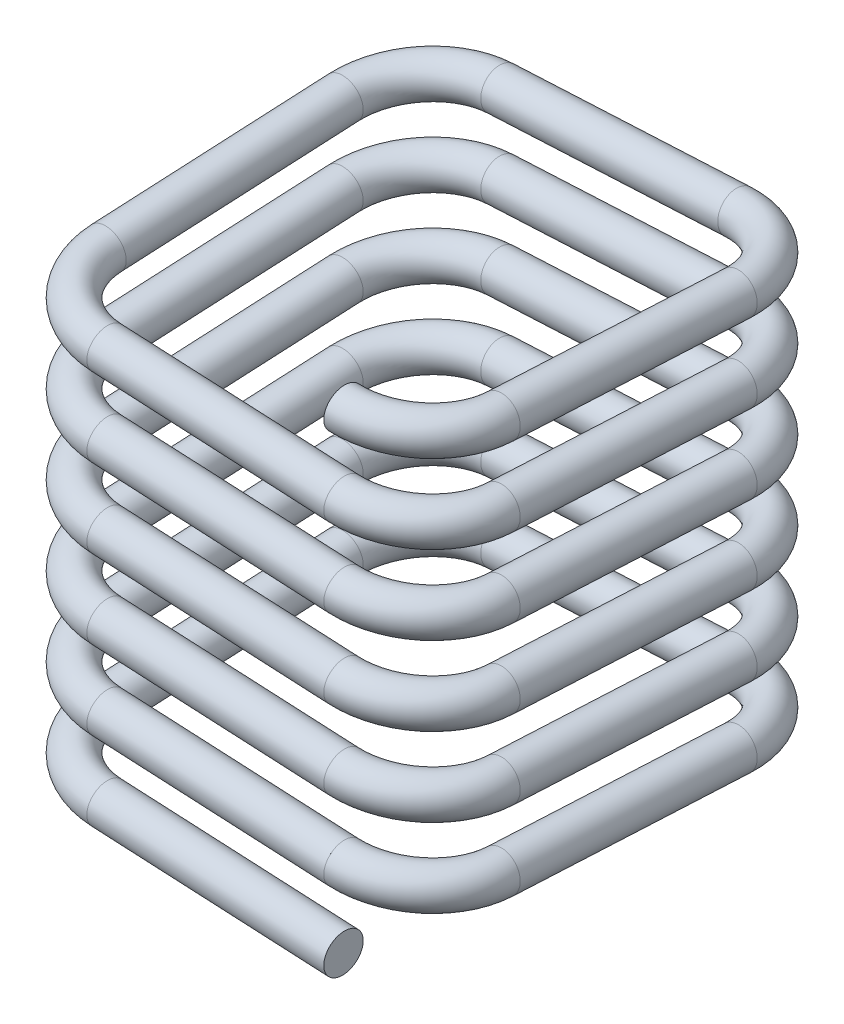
ISO-10303-21;
HEADER;
FILE_DESCRIPTION(('STEP AP214'),'2;1');
FILE_NAME('part.step','',(''),(''),'','','');
FILE_SCHEMA(('AUTOMOTIVE_DESIGN { 1 0 10303 214 1 1 1 1 }'));
ENDSEC;
DATA;
#1=APPLICATION_CONTEXT('core data for automotive mechanical design processes');
#2=APPLICATION_PROTOCOL_DEFINITION('international standard','automotive_design',2000,#1);
#3=PRODUCT_CONTEXT('',#1,'mechanical');
#4=PRODUCT('Part','Part','',(#3));
#5=PRODUCT_RELATED_PRODUCT_CATEGORY('part','',(#4));
#6=PRODUCT_DEFINITION_FORMATION('','',#4);
#7=PRODUCT_DEFINITION_CONTEXT('part definition',#1,'design');
#8=PRODUCT_DEFINITION('design','',#6,#7);
#9=PRODUCT_DEFINITION_SHAPE('','',#8);
#10=(LENGTH_UNIT() NAMED_UNIT(*) SI_UNIT(.MILLI.,.METRE.));
#11=(NAMED_UNIT(*) PLANE_ANGLE_UNIT() SI_UNIT($,.RADIAN.));
#12=(NAMED_UNIT(*) SI_UNIT($,.STERADIAN.) SOLID_ANGLE_UNIT());
#13=UNCERTAINTY_MEASURE_WITH_UNIT(LENGTH_MEASURE(1.E-05),#10,'distance_accuracy_value','');
#14=(GEOMETRIC_REPRESENTATION_CONTEXT(3) GLOBAL_UNCERTAINTY_ASSIGNED_CONTEXT((#13)) GLOBAL_UNIT_ASSIGNED_CONTEXT((#10,
#11,#12)) REPRESENTATION_CONTEXT('',''));
#15=CARTESIAN_POINT('',(0.,0.,0.));
#16=DIRECTION('',(0.,0.,1.));
#17=DIRECTION('',(1.,0.,0.));
#18=AXIS2_PLACEMENT_3D('',#15,#16,#17);
#19=CARTESIAN_POINT('',(30.0248911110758,120.,30.0248911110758));
#20=DIRECTION('',(-0.0498754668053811,-0.997509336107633,0.0498754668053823));
#21=DIRECTION('',(0.,-0.0499376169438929,-0.998752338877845));
#22=AXIS2_PLACEMENT_3D('',#19,#20,#21);
#23=TOROIDAL_SURFACE('',#22,20.,5.);
#24=CARTESIAN_POINT('',(50.,119.00373521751,30.0747043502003));
#25=DIRECTION('',(0.,0.0499376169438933,0.998752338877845));
#26=DIRECTION('',(0.294924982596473,-0.954328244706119,0.0477164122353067));
#27=AXIS2_PLACEMENT_3D('',#24,#25,#26);
#28=CIRCLE('',#27,5.);
#29=CARTESIAN_POINT('',(54.9937772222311,118.754669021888,30.0871576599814));
#30=VERTEX_POINT('',#29);
#31=EDGE_CURVE('E48',#30,#30,#28,.T.);
#32=CARTESIAN_POINT('',(30.0747043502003,120.99626478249,50.));
#33=DIRECTION('',(-0.998752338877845,0.0499376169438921,0.));
#34=DIRECTION('',(-0.0460117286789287,-0.920234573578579,0.388653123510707));
#35=AXIS2_PLACEMENT_3D('',#32,#33,#34);
#36=CIRCLE('',#35,5.);
#37=CARTESIAN_POINT('',(30.0871576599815,121.245330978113,54.9937772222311));
#38=VERTEX_POINT('',#37);
#39=EDGE_CURVE('E11',#38,#38,#36,.T.);
#40=CARTESIAN_POINT('',(30.0248911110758,120.,30.0248911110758));
#41=DIRECTION('',(-0.0498754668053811,-0.997509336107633,0.0498754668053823));
#42=DIRECTION('',(0.,-0.0499376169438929,-0.998752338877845));
#43=AXIS2_PLACEMENT_3D('',#40,#41,#42);
#44=CIRCLE('',#43,25.);
#45=EDGE_CURVE('',#30,#38,#44,.T.);
#46=ORIENTED_EDGE('',*,*,#31,.T.);
#47=ORIENTED_EDGE('',*,*,#39,.F.);
#48=ORIENTED_EDGE('',*,*,#45,.T.);
#49=ORIENTED_EDGE('',*,*,#45,.F.);
#50=EDGE_LOOP('',(#46,#48,#47,#49));
#51=FACE_BOUND('',#50,.T.);
#52=ADVANCED_FACE('F42',(#51),#23,.T.);
#53=CARTESIAN_POINT('',(50.,115.99626478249,-30.0747043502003));
#54=DIRECTION('',(0.,0.0499376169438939,0.998752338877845));
#55=DIRECTION('',(0.,-0.998752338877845,0.0499376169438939));
#56=AXIS2_PLACEMENT_3D('',#53,#54,#55);
#57=CYLINDRICAL_SURFACE('',#56,5.);
#58=CARTESIAN_POINT('',(50.,115.99626478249,-30.0747043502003));
#59=DIRECTION('',(0.,0.0499376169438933,0.998752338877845));
#60=DIRECTION('',(0.294924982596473,-0.954328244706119,0.0477164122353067));
#61=AXIS2_PLACEMENT_3D('',#58,#59,#60);
#62=CIRCLE('',#61,5.);
#63=CARTESIAN_POINT('',(54.9937772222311,116.245330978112,-30.0871576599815));
#64=VERTEX_POINT('',#63);
#65=EDGE_CURVE('E52',#64,#64,#62,.T.);
#66=ORIENTED_EDGE('',*,*,#65,.T.);
#67=EDGE_LOOP('',(#66));
#68=FACE_BOUND('',#67,.T.);
#69=ORIENTED_EDGE('',*,*,#31,.F.);
#70=EDGE_LOOP('',(#69));
#71=FACE_BOUND('',#70,.T.);
#72=ADVANCED_FACE('F95',(#68,#71),#57,.T.);
#73=CARTESIAN_POINT('',(30.0248911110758,115.,-30.0248911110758));
#74=DIRECTION('',(0.0498754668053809,-0.997509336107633,0.0498754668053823));
#75=DIRECTION('',(0.,-0.0499376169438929,-0.998752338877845));
#76=AXIS2_PLACEMENT_3D('',#73,#74,#75);
#77=TOROIDAL_SURFACE('',#76,20.,5.);
#78=CARTESIAN_POINT('',(30.0747043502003,114.00373521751,-50.));
#79=DIRECTION('',(0.998752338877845,0.0499376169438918,0.));
#80=DIRECTION('',(0.0489463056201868,-0.978926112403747,-0.198262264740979));
#81=AXIS2_PLACEMENT_3D('',#78,#79,#80);
#82=CIRCLE('',#81,5.);
#83=CARTESIAN_POINT('',(30.0871576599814,113.754669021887,-54.9937772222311));
#84=VERTEX_POINT('',#83);
#85=EDGE_CURVE('E56',#84,#84,#82,.T.);
#86=CARTESIAN_POINT('',(30.0248911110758,115.,-30.0248911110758));
#87=DIRECTION('',(0.0498754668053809,-0.997509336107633,0.0498754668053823));
#88=DIRECTION('',(0.,-0.0499376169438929,-0.998752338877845));
#89=AXIS2_PLACEMENT_3D('',#86,#87,#88);
#90=CIRCLE('',#89,25.);
#91=EDGE_CURVE('',#84,#64,#90,.T.);
#92=ORIENTED_EDGE('',*,*,#85,.T.);
#93=ORIENTED_EDGE('',*,*,#65,.F.);
#94=ORIENTED_EDGE('',*,*,#91,.T.);
#95=ORIENTED_EDGE('',*,*,#91,.F.);
#96=EDGE_LOOP('',(#92,#94,#93,#95));
#97=FACE_BOUND('',#96,.T.);
#98=ADVANCED_FACE('F99',(#97),#77,.T.);
#99=CARTESIAN_POINT('',(-30.0747043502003,110.99626478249,-50.));
#100=DIRECTION('',(0.998752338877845,0.0499376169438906,0.));
#101=DIRECTION('',(-0.0499376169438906,0.998752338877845,0.));
#102=AXIS2_PLACEMENT_3D('',#99,#100,#101);
#103=CYLINDRICAL_SURFACE('',#102,5.);
#104=CARTESIAN_POINT('',(-30.0747043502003,110.99626478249,-50.));
#105=DIRECTION('',(0.998752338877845,0.0499376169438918,0.));
#106=DIRECTION('',(0.0489463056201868,-0.978926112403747,-0.198262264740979));
#107=AXIS2_PLACEMENT_3D('',#104,#105,#106);
#108=CIRCLE('',#107,5.);
#109=CARTESIAN_POINT('',(-30.0871576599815,111.245330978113,-54.993777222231));
#110=VERTEX_POINT('',#109);
#111=EDGE_CURVE('E61',#110,#110,#108,.T.);
#112=ORIENTED_EDGE('',*,*,#111,.T.);
#113=EDGE_LOOP('',(#112));
#114=FACE_BOUND('',#113,.T.);
#115=ORIENTED_EDGE('',*,*,#85,.F.);
#116=EDGE_LOOP('',(#115));
#117=FACE_BOUND('',#116,.T.);
#118=ADVANCED_FACE('F105',(#114,#117),#103,.T.);
#119=CARTESIAN_POINT('',(-30.0248911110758,110.,-30.0248911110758));
#120=DIRECTION('',(0.0498754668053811,-0.997509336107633,-0.0498754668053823));
#121=DIRECTION('',(0.,0.0499376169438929,-0.998752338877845));
#122=AXIS2_PLACEMENT_3D('',#119,#120,#121);
#123=TOROIDAL_SURFACE('',#122,20.,5.);
#124=CARTESIAN_POINT('',(-50.,109.00373521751,-30.0747043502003));
#125=DIRECTION('',(0.,0.049937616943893,-0.998752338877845));
#126=DIRECTION('',(-0.099626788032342,-0.993783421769,-0.0496891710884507));
#127=AXIS2_PLACEMENT_3D('',#124,#125,#126);
#128=CIRCLE('',#127,5.);
#129=CARTESIAN_POINT('',(-54.9937772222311,108.754669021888,-30.0871576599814));
#130=VERTEX_POINT('',#129);
#131=EDGE_CURVE('E64',#130,#130,#128,.T.);
#132=CARTESIAN_POINT('',(-30.0248911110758,110.,-30.0248911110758));
#133=DIRECTION('',(0.0498754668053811,-0.997509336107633,-0.0498754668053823));
#134=DIRECTION('',(0.,0.0499376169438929,-0.998752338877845));
#135=AXIS2_PLACEMENT_3D('',#132,#133,#134);
#136=CIRCLE('',#135,25.);
#137=EDGE_CURVE('',#130,#110,#136,.T.);
#138=ORIENTED_EDGE('',*,*,#131,.T.);
#139=ORIENTED_EDGE('',*,*,#111,.F.);
#140=ORIENTED_EDGE('',*,*,#137,.T.);
#141=ORIENTED_EDGE('',*,*,#137,.F.);
#142=EDGE_LOOP('',(#138,#140,#139,#141));
#143=FACE_BOUND('',#142,.T.);
#144=ADVANCED_FACE('F112',(#143),#123,.T.);
#145=CARTESIAN_POINT('',(-50.,105.99626478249,30.0747043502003));
#146=DIRECTION('',(0.,0.049937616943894,-0.998752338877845));
#147=DIRECTION('',(0.,0.998752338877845,0.0499376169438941));
#148=AXIS2_PLACEMENT_3D('',#145,#146,#147);
#149=CYLINDRICAL_SURFACE('',#148,5.);
#150=CARTESIAN_POINT('',(-50.,105.99626478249,30.0747043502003));
#151=DIRECTION('',(0.,0.049937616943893,-0.998752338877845));
#152=DIRECTION('',(-0.099626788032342,-0.993783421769,-0.0496891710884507));
#153=AXIS2_PLACEMENT_3D('',#150,#151,#152);
#154=CIRCLE('',#153,5.);
#155=CARTESIAN_POINT('',(-54.993777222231,106.245330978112,30.0871576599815));
#156=VERTEX_POINT('',#155);
#157=EDGE_CURVE('E67',#156,#156,#154,.T.);
#158=ORIENTED_EDGE('',*,*,#157,.T.);
#159=EDGE_LOOP('',(#158));
#160=FACE_BOUND('',#159,.T.);
#161=ORIENTED_EDGE('',*,*,#131,.F.);
#162=EDGE_LOOP('',(#161));
#163=FACE_BOUND('',#162,.T.);
#164=ADVANCED_FACE('F116',(#160,#163),#149,.T.);
#165=CARTESIAN_POINT('',(-30.0248911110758,105.,30.0248911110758));
#166=DIRECTION('',(-0.0498754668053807,-0.997509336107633,-0.0498754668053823));
#167=DIRECTION('',(0.,0.0499376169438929,-0.998752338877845));
#168=AXIS2_PLACEMENT_3D('',#165,#166,#167);
#169=TOROIDAL_SURFACE('',#168,20.,5.);
#170=CARTESIAN_POINT('',(-30.0747043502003,104.00373521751,50.));
#171=DIRECTION('',(-0.998752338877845,0.0499376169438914,0.));
#172=DIRECTION('',(-0.0499376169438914,-0.998752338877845,0.));
#173=AXIS2_PLACEMENT_3D('',#170,#171,#172);
#174=CIRCLE('',#173,5.);
#175=CARTESIAN_POINT('',(-30.0871576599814,103.754669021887,54.9937772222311));
#176=VERTEX_POINT('',#175);
#177=EDGE_CURVE('E70',#176,#176,#174,.T.);
#178=CARTESIAN_POINT('',(-30.0248911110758,105.,30.0248911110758));
#179=DIRECTION('',(-0.0498754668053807,-0.997509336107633,-0.0498754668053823));
#180=DIRECTION('',(0.,0.0499376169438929,-0.998752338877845));
#181=AXIS2_PLACEMENT_3D('',#178,#179,#180);
#182=CIRCLE('',#181,25.);
#183=EDGE_CURVE('',#176,#156,#182,.T.);
#184=ORIENTED_EDGE('',*,*,#177,.T.);
#185=ORIENTED_EDGE('',*,*,#157,.F.);
#186=ORIENTED_EDGE('',*,*,#183,.T.);
#187=ORIENTED_EDGE('',*,*,#183,.F.);
#188=EDGE_LOOP('',(#184,#186,#185,#187));
#189=FACE_BOUND('',#188,.T.);
#190=ADVANCED_FACE('F77',(#189),#169,.T.);
#191=CARTESIAN_POINT('',(-30.0747043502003,104.00373521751,50.));
#192=DIRECTION('',(0.998752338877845,-0.0499376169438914,0.));
#193=DIRECTION('',(0.0499376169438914,0.998752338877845,0.));
#194=AXIS2_PLACEMENT_3D('',#191,#192,#193);
#195=CYLINDRICAL_SURFACE('',#194,5.);
#196=ORIENTED_EDGE('',*,*,#177,.F.);
#197=EDGE_LOOP('',(#196));
#198=FACE_BOUND('',#197,.T.);
#199=CARTESIAN_POINT('',(30.0747043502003,100.99626478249,50.));
#200=DIRECTION('',(-0.998752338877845,0.0499376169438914,0.));
#201=DIRECTION('',(-0.0499376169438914,-0.998752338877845,0.));
#202=AXIS2_PLACEMENT_3D('',#199,#200,#201);
#203=CIRCLE('',#202,5.);
#204=CARTESIAN_POINT('',(29.8250162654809,96.0025030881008,50.));
#205=VERTEX_POINT('',#204);
#206=EDGE_CURVE('E71',#205,#205,#203,.T.);
#207=ORIENTED_EDGE('',*,*,#206,.T.);
#208=EDGE_LOOP('',(#207));
#209=FACE_BOUND('',#208,.T.);
#210=ADVANCED_FACE('F80',(#198,#209),#195,.T.);
#211=CARTESIAN_POINT('',(30.0747043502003,120.99626478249,50.));
#212=DIRECTION('',(-0.998752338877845,0.0499376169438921,0.));
#213=DIRECTION('',(-0.0460117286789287,-0.920234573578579,0.388653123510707));
#214=AXIS2_PLACEMENT_3D('',#211,#212,#213);
#215=PLANE('',#214);
#216=ORIENTED_EDGE('',*,*,#39,.T.);
#217=EDGE_LOOP('',(#216));
#218=FACE_BOUND('',#217,.T.);
#219=ADVANCED_FACE('F83',(#218),#215,.T.);
#220=CARTESIAN_POINT('',(30.0747043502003,100.99626478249,50.));
#221=DIRECTION('',(-0.998752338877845,0.0499376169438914,0.));
#222=DIRECTION('',(-0.0499376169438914,-0.998752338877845,0.));
#223=AXIS2_PLACEMENT_3D('',#220,#221,#222);
#224=PLANE('',#223);
#225=ORIENTED_EDGE('',*,*,#206,.F.);
#226=EDGE_LOOP('',(#225));
#227=FACE_BOUND('',#226,.T.);
#228=ADVANCED_FACE('F87',(#227),#224,.F.);
#229=CLOSED_SHELL('',(#52,#72,#98,#118,#144,#164,#190,#210,#219,#228));
#230=MANIFOLD_SOLID_BREP('B2',#229);
#231=CARTESIAN_POINT('',(30.0248911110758,100.,30.0248911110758));
#232=DIRECTION('',(-0.0498754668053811,-0.997509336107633,0.0498754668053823));
#233=DIRECTION('',(0.,-0.0499376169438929,-0.998752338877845));
#234=AXIS2_PLACEMENT_3D('',#231,#232,#233);
#235=TOROIDAL_SURFACE('',#234,20.,5.);
#236=CARTESIAN_POINT('',(50.,99.0037352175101,30.0747043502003));
#237=DIRECTION('',(0.,0.0499376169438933,0.998752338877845));
#238=DIRECTION('',(0.294924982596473,-0.954328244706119,0.0477164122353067));
#239=AXIS2_PLACEMENT_3D('',#236,#237,#238);
#240=CIRCLE('',#239,5.);
#241=CARTESIAN_POINT('',(54.9937772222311,98.7546690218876,30.0871576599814));
#242=VERTEX_POINT('',#241);
#243=EDGE_CURVE('E202',#242,#242,#240,.T.);
#244=CARTESIAN_POINT('',(30.0747043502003,100.99626478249,50.));
#245=DIRECTION('',(-0.998752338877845,0.0499376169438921,0.));
#246=DIRECTION('',(-0.0460117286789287,-0.920234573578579,0.388653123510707));
#247=AXIS2_PLACEMENT_3D('',#244,#245,#246);
#248=CIRCLE('',#247,5.);
#249=CARTESIAN_POINT('',(30.0871576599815,101.245330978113,54.9937772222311));
#250=VERTEX_POINT('',#249);
#251=EDGE_CURVE('E41',#250,#250,#248,.T.);
#252=CARTESIAN_POINT('',(30.0248911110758,100.,30.0248911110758));
#253=DIRECTION('',(-0.0498754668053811,-0.997509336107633,0.0498754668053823));
#254=DIRECTION('',(0.,-0.0499376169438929,-0.998752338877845));
#255=AXIS2_PLACEMENT_3D('',#252,#253,#254);
#256=CIRCLE('',#255,25.);
#257=EDGE_CURVE('',#242,#250,#256,.T.);
#258=ORIENTED_EDGE('',*,*,#243,.T.);
#259=ORIENTED_EDGE('',*,*,#251,.F.);
#260=ORIENTED_EDGE('',*,*,#257,.T.);
#261=ORIENTED_EDGE('',*,*,#257,.F.);
#262=EDGE_LOOP('',(#258,#260,#259,#261));
#263=FACE_BOUND('',#262,.T.);
#264=ADVANCED_FACE('F196',(#263),#235,.T.);
#265=CARTESIAN_POINT('',(50.,95.9962647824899,-30.0747043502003));
#266=DIRECTION('',(0.,0.0499376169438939,0.998752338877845));
#267=DIRECTION('',(0.,-0.998752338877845,0.0499376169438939));
#268=AXIS2_PLACEMENT_3D('',#265,#266,#267);
#269=CYLINDRICAL_SURFACE('',#268,5.);
#270=CARTESIAN_POINT('',(50.,95.9962647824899,-30.0747043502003));
#271=DIRECTION('',(0.,0.0499376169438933,0.998752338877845));
#272=DIRECTION('',(0.294924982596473,-0.954328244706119,0.0477164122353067));
#273=AXIS2_PLACEMENT_3D('',#270,#271,#272);
#274=CIRCLE('',#273,5.);
#275=CARTESIAN_POINT('',(54.9937772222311,96.2453309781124,-30.0871576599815));
#276=VERTEX_POINT('',#275);
#277=EDGE_CURVE('E206',#276,#276,#274,.T.);
#278=ORIENTED_EDGE('',*,*,#277,.T.);
#279=EDGE_LOOP('',(#278));
#280=FACE_BOUND('',#279,.T.);
#281=ORIENTED_EDGE('',*,*,#243,.F.);
#282=EDGE_LOOP('',(#281));
#283=FACE_BOUND('',#282,.T.);
#284=ADVANCED_FACE('F249',(#280,#283),#269,.T.);
#285=CARTESIAN_POINT('',(30.0248911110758,95.,-30.0248911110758));
#286=DIRECTION('',(0.0498754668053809,-0.997509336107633,0.0498754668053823));
#287=DIRECTION('',(0.,-0.0499376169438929,-0.998752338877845));
#288=AXIS2_PLACEMENT_3D('',#285,#286,#287);
#289=TOROIDAL_SURFACE('',#288,20.,5.);
#290=CARTESIAN_POINT('',(30.0747043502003,94.00373521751,-50.));
#291=DIRECTION('',(0.998752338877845,0.0499376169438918,0.));
#292=DIRECTION('',(0.0489463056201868,-0.978926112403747,-0.198262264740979));
#293=AXIS2_PLACEMENT_3D('',#290,#291,#292);
#294=CIRCLE('',#293,5.);
#295=CARTESIAN_POINT('',(30.0871576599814,93.7546690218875,-54.9937772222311));
#296=VERTEX_POINT('',#295);
#297=EDGE_CURVE('E210',#296,#296,#294,.T.);
#298=CARTESIAN_POINT('',(30.0248911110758,95.,-30.0248911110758));
#299=DIRECTION('',(0.0498754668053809,-0.997509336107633,0.0498754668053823));
#300=DIRECTION('',(0.,-0.0499376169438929,-0.998752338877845));
#301=AXIS2_PLACEMENT_3D('',#298,#299,#300);
#302=CIRCLE('',#301,25.);
#303=EDGE_CURVE('',#296,#276,#302,.T.);
#304=ORIENTED_EDGE('',*,*,#297,.T.);
#305=ORIENTED_EDGE('',*,*,#277,.F.);
#306=ORIENTED_EDGE('',*,*,#303,.T.);
#307=ORIENTED_EDGE('',*,*,#303,.F.);
#308=EDGE_LOOP('',(#304,#306,#305,#307));
#309=FACE_BOUND('',#308,.T.);
#310=ADVANCED_FACE('F253',(#309),#289,.T.);
#311=CARTESIAN_POINT('',(-30.0747043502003,90.99626478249,-50.));
#312=DIRECTION('',(0.998752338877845,0.0499376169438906,0.));
#313=DIRECTION('',(-0.0499376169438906,0.998752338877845,0.));
#314=AXIS2_PLACEMENT_3D('',#311,#312,#313);
#315=CYLINDRICAL_SURFACE('',#314,5.);
#316=CARTESIAN_POINT('',(-30.0747043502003,90.99626478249,-50.));
#317=DIRECTION('',(0.998752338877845,0.0499376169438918,0.));
#318=DIRECTION('',(0.0489463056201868,-0.978926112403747,-0.198262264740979));
#319=AXIS2_PLACEMENT_3D('',#316,#317,#318);
#320=CIRCLE('',#319,5.);
#321=CARTESIAN_POINT('',(-30.0871576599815,91.2453309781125,-54.993777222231));
#322=VERTEX_POINT('',#321);
#323=EDGE_CURVE('E215',#322,#322,#320,.T.);
#324=ORIENTED_EDGE('',*,*,#323,.T.);
#325=EDGE_LOOP('',(#324));
#326=FACE_BOUND('',#325,.T.);
#327=ORIENTED_EDGE('',*,*,#297,.F.);
#328=EDGE_LOOP('',(#327));
#329=FACE_BOUND('',#328,.T.);
#330=ADVANCED_FACE('F259',(#326,#329),#315,.T.);
#331=CARTESIAN_POINT('',(-30.0248911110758,90.,-30.0248911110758));
#332=DIRECTION('',(0.0498754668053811,-0.997509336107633,-0.0498754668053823));
#333=DIRECTION('',(0.,0.0499376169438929,-0.998752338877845));
#334=AXIS2_PLACEMENT_3D('',#331,#332,#333);
#335=TOROIDAL_SURFACE('',#334,20.,5.);
#336=CARTESIAN_POINT('',(-50.,89.0037352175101,-30.0747043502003));
#337=DIRECTION('',(0.,0.049937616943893,-0.998752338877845));
#338=DIRECTION('',(-0.099626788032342,-0.993783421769,-0.0496891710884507));
#339=AXIS2_PLACEMENT_3D('',#336,#337,#338);
#340=CIRCLE('',#339,5.);
#341=CARTESIAN_POINT('',(-54.9937772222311,88.7546690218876,-30.0871576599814));
#342=VERTEX_POINT('',#341);
#343=EDGE_CURVE('E218',#342,#342,#340,.T.);
#344=CARTESIAN_POINT('',(-30.0248911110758,90.,-30.0248911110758));
#345=DIRECTION('',(0.0498754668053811,-0.997509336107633,-0.0498754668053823));
#346=DIRECTION('',(0.,0.0499376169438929,-0.998752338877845));
#347=AXIS2_PLACEMENT_3D('',#344,#345,#346);
#348=CIRCLE('',#347,25.);
#349=EDGE_CURVE('',#342,#322,#348,.T.);
#350=ORIENTED_EDGE('',*,*,#343,.T.);
#351=ORIENTED_EDGE('',*,*,#323,.F.);
#352=ORIENTED_EDGE('',*,*,#349,.T.);
#353=ORIENTED_EDGE('',*,*,#349,.F.);
#354=EDGE_LOOP('',(#350,#352,#351,#353));
#355=FACE_BOUND('',#354,.T.);
#356=ADVANCED_FACE('F266',(#355),#335,.T.);
#357=CARTESIAN_POINT('',(-50.,85.9962647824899,30.0747043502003));
#358=DIRECTION('',(0.,0.049937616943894,-0.998752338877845));
#359=DIRECTION('',(0.,0.998752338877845,0.0499376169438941));
#360=AXIS2_PLACEMENT_3D('',#357,#358,#359);
#361=CYLINDRICAL_SURFACE('',#360,5.);
#362=CARTESIAN_POINT('',(-50.,85.9962647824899,30.0747043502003));
#363=DIRECTION('',(0.,0.049937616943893,-0.998752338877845));
#364=DIRECTION('',(-0.099626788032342,-0.993783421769,-0.0496891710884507));
#365=AXIS2_PLACEMENT_3D('',#362,#363,#364);
#366=CIRCLE('',#365,5.);
#367=CARTESIAN_POINT('',(-54.993777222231,86.2453309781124,30.0871576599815));
#368=VERTEX_POINT('',#367);
#369=EDGE_CURVE('E221',#368,#368,#366,.T.);
#370=ORIENTED_EDGE('',*,*,#369,.T.);
#371=EDGE_LOOP('',(#370));
#372=FACE_BOUND('',#371,.T.);
#373=ORIENTED_EDGE('',*,*,#343,.F.);
#374=EDGE_LOOP('',(#373));
#375=FACE_BOUND('',#374,.T.);
#376=ADVANCED_FACE('F270',(#372,#375),#361,.T.);
#377=CARTESIAN_POINT('',(-30.0248911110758,85.,30.0248911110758));
#378=DIRECTION('',(-0.0498754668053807,-0.997509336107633,-0.0498754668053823));
#379=DIRECTION('',(0.,0.0499376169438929,-0.998752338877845));
#380=AXIS2_PLACEMENT_3D('',#377,#378,#379);
#381=TOROIDAL_SURFACE('',#380,20.,5.);
#382=CARTESIAN_POINT('',(-30.0747043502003,84.00373521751,50.));
#383=DIRECTION('',(-0.998752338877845,0.0499376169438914,0.));
#384=DIRECTION('',(-0.0499376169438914,-0.998752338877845,0.));
#385=AXIS2_PLACEMENT_3D('',#382,#383,#384);
#386=CIRCLE('',#385,5.);
#387=CARTESIAN_POINT('',(-30.0871576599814,83.7546690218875,54.9937772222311));
#388=VERTEX_POINT('',#387);
#389=EDGE_CURVE('E224',#388,#388,#386,.T.);
#390=CARTESIAN_POINT('',(-30.0248911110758,85.,30.0248911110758));
#391=DIRECTION('',(-0.0498754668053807,-0.997509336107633,-0.0498754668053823));
#392=DIRECTION('',(0.,0.0499376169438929,-0.998752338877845));
#393=AXIS2_PLACEMENT_3D('',#390,#391,#392);
#394=CIRCLE('',#393,25.);
#395=EDGE_CURVE('',#388,#368,#394,.T.);
#396=ORIENTED_EDGE('',*,*,#389,.T.);
#397=ORIENTED_EDGE('',*,*,#369,.F.);
#398=ORIENTED_EDGE('',*,*,#395,.T.);
#399=ORIENTED_EDGE('',*,*,#395,.F.);
#400=EDGE_LOOP('',(#396,#398,#397,#399));
#401=FACE_BOUND('',#400,.T.);
#402=ADVANCED_FACE('F231',(#401),#381,.T.);
#403=CARTESIAN_POINT('',(-30.0747043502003,84.00373521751,50.));
#404=DIRECTION('',(0.998752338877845,-0.0499376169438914,0.));
#405=DIRECTION('',(0.0499376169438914,0.998752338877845,0.));
#406=AXIS2_PLACEMENT_3D('',#403,#404,#405);
#407=CYLINDRICAL_SURFACE('',#406,5.);
#408=ORIENTED_EDGE('',*,*,#389,.F.);
#409=EDGE_LOOP('',(#408));
#410=FACE_BOUND('',#409,.T.);
#411=CARTESIAN_POINT('',(30.0747043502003,80.99626478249,50.));
#412=DIRECTION('',(-0.998752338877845,0.0499376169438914,0.));
#413=DIRECTION('',(-0.0499376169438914,-0.998752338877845,0.));
#414=AXIS2_PLACEMENT_3D('',#411,#412,#413);
#415=CIRCLE('',#414,5.);
#416=CARTESIAN_POINT('',(29.8250162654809,76.0025030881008,50.));
#417=VERTEX_POINT('',#416);
#418=EDGE_CURVE('E225',#417,#417,#415,.T.);
#419=ORIENTED_EDGE('',*,*,#418,.T.);
#420=EDGE_LOOP('',(#419));
#421=FACE_BOUND('',#420,.T.);
#422=ADVANCED_FACE('F234',(#410,#421),#407,.T.);
#423=CARTESIAN_POINT('',(30.0747043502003,100.99626478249,50.));
#424=DIRECTION('',(-0.998752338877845,0.0499376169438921,0.));
#425=DIRECTION('',(-0.0460117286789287,-0.920234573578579,0.388653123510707));
#426=AXIS2_PLACEMENT_3D('',#423,#424,#425);
#427=PLANE('',#426);
#428=ORIENTED_EDGE('',*,*,#251,.T.);
#429=EDGE_LOOP('',(#428));
#430=FACE_BOUND('',#429,.T.);
#431=ADVANCED_FACE('F237',(#430),#427,.T.);
#432=CARTESIAN_POINT('',(30.0747043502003,80.99626478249,50.));
#433=DIRECTION('',(-0.998752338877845,0.0499376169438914,0.));
#434=DIRECTION('',(-0.0499376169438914,-0.998752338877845,0.));
#435=AXIS2_PLACEMENT_3D('',#432,#433,#434);
#436=PLANE('',#435);
#437=ORIENTED_EDGE('',*,*,#418,.F.);
#438=EDGE_LOOP('',(#437));
#439=FACE_BOUND('',#438,.T.);
#440=ADVANCED_FACE('F241',(#439),#436,.F.);
#441=CLOSED_SHELL('',(#264,#284,#310,#330,#356,#376,#402,#422,#431,#440));
#442=MANIFOLD_SOLID_BREP('B6',#441);
#443=CARTESIAN_POINT('',(30.0248911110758,80.,30.0248911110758));
#444=DIRECTION('',(-0.0498754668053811,-0.997509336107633,0.0498754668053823));
#445=DIRECTION('',(0.,-0.0499376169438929,-0.998752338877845));
#446=AXIS2_PLACEMENT_3D('',#443,#444,#445);
#447=TOROIDAL_SURFACE('',#446,20.,5.);
#448=CARTESIAN_POINT('',(50.,79.0037352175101,30.0747043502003));
#449=DIRECTION('',(0.,0.0499376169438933,0.998752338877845));
#450=DIRECTION('',(0.294924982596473,-0.954328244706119,0.0477164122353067));
#451=AXIS2_PLACEMENT_3D('',#448,#449,#450);
#452=CIRCLE('',#451,5.);
#453=CARTESIAN_POINT('',(54.9937772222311,78.7546690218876,30.0871576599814));
#454=VERTEX_POINT('',#453);
#455=EDGE_CURVE('E356',#454,#454,#452,.T.);
#456=CARTESIAN_POINT('',(30.0747043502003,80.99626478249,50.));
#457=DIRECTION('',(-0.998752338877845,0.0499376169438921,0.));
#458=DIRECTION('',(-0.0460117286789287,-0.920234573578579,0.388653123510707));
#459=AXIS2_PLACEMENT_3D('',#456,#457,#458);
#460=CIRCLE('',#459,5.);
#461=CARTESIAN_POINT('',(30.0871576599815,81.2453309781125,54.9937772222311));
#462=VERTEX_POINT('',#461);
#463=EDGE_CURVE('E195',#462,#462,#460,.T.);
#464=CARTESIAN_POINT('',(30.0248911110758,80.,30.0248911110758));
#465=DIRECTION('',(-0.0498754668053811,-0.997509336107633,0.0498754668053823));
#466=DIRECTION('',(0.,-0.0499376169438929,-0.998752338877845));
#467=AXIS2_PLACEMENT_3D('',#464,#465,#466);
#468=CIRCLE('',#467,25.);
#469=EDGE_CURVE('',#454,#462,#468,.T.);
#470=ORIENTED_EDGE('',*,*,#455,.T.);
#471=ORIENTED_EDGE('',*,*,#463,.F.);
#472=ORIENTED_EDGE('',*,*,#469,.T.);
#473=ORIENTED_EDGE('',*,*,#469,.F.);
#474=EDGE_LOOP('',(#470,#472,#471,#473));
#475=FACE_BOUND('',#474,.T.);
#476=ADVANCED_FACE('F350',(#475),#447,.T.);
#477=CARTESIAN_POINT('',(50.,75.9962647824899,-30.0747043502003));
#478=DIRECTION('',(0.,0.0499376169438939,0.998752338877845));
#479=DIRECTION('',(0.,-0.998752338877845,0.0499376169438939));
#480=AXIS2_PLACEMENT_3D('',#477,#478,#479);
#481=CYLINDRICAL_SURFACE('',#480,5.);
#482=CARTESIAN_POINT('',(50.,75.9962647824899,-30.0747043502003));
#483=DIRECTION('',(0.,0.0499376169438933,0.998752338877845));
#484=DIRECTION('',(0.294924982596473,-0.954328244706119,0.0477164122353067));
#485=AXIS2_PLACEMENT_3D('',#482,#483,#484);
#486=CIRCLE('',#485,5.);
#487=CARTESIAN_POINT('',(54.9937772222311,76.2453309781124,-30.0871576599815));
#488=VERTEX_POINT('',#487);
#489=EDGE_CURVE('E360',#488,#488,#486,.T.);
#490=ORIENTED_EDGE('',*,*,#489,.T.);
#491=EDGE_LOOP('',(#490));
#492=FACE_BOUND('',#491,.T.);
#493=ORIENTED_EDGE('',*,*,#455,.F.);
#494=EDGE_LOOP('',(#493));
#495=FACE_BOUND('',#494,.T.);
#496=ADVANCED_FACE('F403',(#492,#495),#481,.T.);
#497=CARTESIAN_POINT('',(30.0248911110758,75.,-30.0248911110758));
#498=DIRECTION('',(0.0498754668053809,-0.997509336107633,0.0498754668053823));
#499=DIRECTION('',(0.,-0.0499376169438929,-0.998752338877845));
#500=AXIS2_PLACEMENT_3D('',#497,#498,#499);
#501=TOROIDAL_SURFACE('',#500,20.,5.);
#502=CARTESIAN_POINT('',(30.0747043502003,74.00373521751,-50.));
#503=DIRECTION('',(0.998752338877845,0.0499376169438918,0.));
#504=DIRECTION('',(0.0489463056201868,-0.978926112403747,-0.198262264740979));
#505=AXIS2_PLACEMENT_3D('',#502,#503,#504);
#506=CIRCLE('',#505,5.);
#507=CARTESIAN_POINT('',(30.0871576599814,73.7546690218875,-54.9937772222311));
#508=VERTEX_POINT('',#507);
#509=EDGE_CURVE('E364',#508,#508,#506,.T.);
#510=CARTESIAN_POINT('',(30.0248911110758,75.,-30.0248911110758));
#511=DIRECTION('',(0.0498754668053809,-0.997509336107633,0.0498754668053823));
#512=DIRECTION('',(0.,-0.0499376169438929,-0.998752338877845));
#513=AXIS2_PLACEMENT_3D('',#510,#511,#512);
#514=CIRCLE('',#513,25.);
#515=EDGE_CURVE('',#508,#488,#514,.T.);
#516=ORIENTED_EDGE('',*,*,#509,.T.);
#517=ORIENTED_EDGE('',*,*,#489,.F.);
#518=ORIENTED_EDGE('',*,*,#515,.T.);
#519=ORIENTED_EDGE('',*,*,#515,.F.);
#520=EDGE_LOOP('',(#516,#518,#517,#519));
#521=FACE_BOUND('',#520,.T.);
#522=ADVANCED_FACE('F407',(#521),#501,.T.);
#523=CARTESIAN_POINT('',(-30.0747043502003,70.99626478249,-50.));
#524=DIRECTION('',(0.998752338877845,0.0499376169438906,0.));
#525=DIRECTION('',(-0.0499376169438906,0.998752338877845,0.));
#526=AXIS2_PLACEMENT_3D('',#523,#524,#525);
#527=CYLINDRICAL_SURFACE('',#526,5.);
#528=CARTESIAN_POINT('',(-30.0747043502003,70.99626478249,-50.));
#529=DIRECTION('',(0.998752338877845,0.0499376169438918,0.));
#530=DIRECTION('',(0.0489463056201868,-0.978926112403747,-0.198262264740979));
#531=AXIS2_PLACEMENT_3D('',#528,#529,#530);
#532=CIRCLE('',#531,5.);
#533=CARTESIAN_POINT('',(-30.0871576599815,71.2453309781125,-54.993777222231));
#534=VERTEX_POINT('',#533);
#535=EDGE_CURVE('E369',#534,#534,#532,.T.);
#536=ORIENTED_EDGE('',*,*,#535,.T.);
#537=EDGE_LOOP('',(#536));
#538=FACE_BOUND('',#537,.T.);
#539=ORIENTED_EDGE('',*,*,#509,.F.);
#540=EDGE_LOOP('',(#539));
#541=FACE_BOUND('',#540,.T.);
#542=ADVANCED_FACE('F413',(#538,#541),#527,.T.);
#543=CARTESIAN_POINT('',(-30.0248911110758,70.,-30.0248911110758));
#544=DIRECTION('',(0.0498754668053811,-0.997509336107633,-0.0498754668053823));
#545=DIRECTION('',(0.,0.0499376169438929,-0.998752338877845));
#546=AXIS2_PLACEMENT_3D('',#543,#544,#545);
#547=TOROIDAL_SURFACE('',#546,20.,5.);
#548=CARTESIAN_POINT('',(-50.,69.0037352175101,-30.0747043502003));
#549=DIRECTION('',(0.,0.049937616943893,-0.998752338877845));
#550=DIRECTION('',(-0.099626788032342,-0.993783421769,-0.0496891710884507));
#551=AXIS2_PLACEMENT_3D('',#548,#549,#550);
#552=CIRCLE('',#551,5.);
#553=CARTESIAN_POINT('',(-54.9937772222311,68.7546690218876,-30.0871576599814));
#554=VERTEX_POINT('',#553);
#555=EDGE_CURVE('E372',#554,#554,#552,.T.);
#556=CARTESIAN_POINT('',(-30.0248911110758,70.,-30.0248911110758));
#557=DIRECTION('',(0.0498754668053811,-0.997509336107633,-0.0498754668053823));
#558=DIRECTION('',(0.,0.0499376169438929,-0.998752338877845));
#559=AXIS2_PLACEMENT_3D('',#556,#557,#558);
#560=CIRCLE('',#559,25.);
#561=EDGE_CURVE('',#554,#534,#560,.T.);
#562=ORIENTED_EDGE('',*,*,#555,.T.);
#563=ORIENTED_EDGE('',*,*,#535,.F.);
#564=ORIENTED_EDGE('',*,*,#561,.T.);
#565=ORIENTED_EDGE('',*,*,#561,.F.);
#566=EDGE_LOOP('',(#562,#564,#563,#565));
#567=FACE_BOUND('',#566,.T.);
#568=ADVANCED_FACE('F420',(#567),#547,.T.);
#569=CARTESIAN_POINT('',(-50.,65.9962647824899,30.0747043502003));
#570=DIRECTION('',(0.,0.049937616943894,-0.998752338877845));
#571=DIRECTION('',(0.,0.998752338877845,0.0499376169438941));
#572=AXIS2_PLACEMENT_3D('',#569,#570,#571);
#573=CYLINDRICAL_SURFACE('',#572,5.);
#574=CARTESIAN_POINT('',(-50.,65.9962647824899,30.0747043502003));
#575=DIRECTION('',(0.,0.049937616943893,-0.998752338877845));
#576=DIRECTION('',(-0.099626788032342,-0.993783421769,-0.0496891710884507));
#577=AXIS2_PLACEMENT_3D('',#574,#575,#576);
#578=CIRCLE('',#577,5.);
#579=CARTESIAN_POINT('',(-54.993777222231,66.2453309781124,30.0871576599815));
#580=VERTEX_POINT('',#579);
#581=EDGE_CURVE('E375',#580,#580,#578,.T.);
#582=ORIENTED_EDGE('',*,*,#581,.T.);
#583=EDGE_LOOP('',(#582));
#584=FACE_BOUND('',#583,.T.);
#585=ORIENTED_EDGE('',*,*,#555,.F.);
#586=EDGE_LOOP('',(#585));
#587=FACE_BOUND('',#586,.T.);
#588=ADVANCED_FACE('F424',(#584,#587),#573,.T.);
#589=CARTESIAN_POINT('',(-30.0248911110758,65.,30.0248911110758));
#590=DIRECTION('',(-0.0498754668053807,-0.997509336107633,-0.0498754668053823));
#591=DIRECTION('',(0.,0.0499376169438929,-0.998752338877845));
#592=AXIS2_PLACEMENT_3D('',#589,#590,#591);
#593=TOROIDAL_SURFACE('',#592,20.,5.);
#594=CARTESIAN_POINT('',(-30.0747043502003,64.00373521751,50.));
#595=DIRECTION('',(-0.998752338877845,0.0499376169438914,0.));
#596=DIRECTION('',(-0.0499376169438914,-0.998752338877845,0.));
#597=AXIS2_PLACEMENT_3D('',#594,#595,#596);
#598=CIRCLE('',#597,5.);
#599=CARTESIAN_POINT('',(-30.0871576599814,63.7546690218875,54.9937772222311));
#600=VERTEX_POINT('',#599);
#601=EDGE_CURVE('E378',#600,#600,#598,.T.);
#602=CARTESIAN_POINT('',(-30.0248911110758,65.,30.0248911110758));
#603=DIRECTION('',(-0.0498754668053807,-0.997509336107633,-0.0498754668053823));
#604=DIRECTION('',(0.,0.0499376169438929,-0.998752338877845));
#605=AXIS2_PLACEMENT_3D('',#602,#603,#604);
#606=CIRCLE('',#605,25.);
#607=EDGE_CURVE('',#600,#580,#606,.T.);
#608=ORIENTED_EDGE('',*,*,#601,.T.);
#609=ORIENTED_EDGE('',*,*,#581,.F.);
#610=ORIENTED_EDGE('',*,*,#607,.T.);
#611=ORIENTED_EDGE('',*,*,#607,.F.);
#612=EDGE_LOOP('',(#608,#610,#609,#611));
#613=FACE_BOUND('',#612,.T.);
#614=ADVANCED_FACE('F385',(#613),#593,.T.);
#615=CARTESIAN_POINT('',(-30.0747043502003,64.00373521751,50.));
#616=DIRECTION('',(0.998752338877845,-0.0499376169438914,0.));
#617=DIRECTION('',(0.0499376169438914,0.998752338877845,0.));
#618=AXIS2_PLACEMENT_3D('',#615,#616,#617);
#619=CYLINDRICAL_SURFACE('',#618,5.);
#620=ORIENTED_EDGE('',*,*,#601,.F.);
#621=EDGE_LOOP('',(#620));
#622=FACE_BOUND('',#621,.T.);
#623=CARTESIAN_POINT('',(30.0747043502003,60.99626478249,50.));
#624=DIRECTION('',(-0.998752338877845,0.0499376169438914,0.));
#625=DIRECTION('',(-0.0499376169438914,-0.998752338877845,0.));
#626=AXIS2_PLACEMENT_3D('',#623,#624,#625);
#627=CIRCLE('',#626,5.);
#628=CARTESIAN_POINT('',(29.8250162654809,56.0025030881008,50.));
#629=VERTEX_POINT('',#628);
#630=EDGE_CURVE('E379',#629,#629,#627,.T.);
#631=ORIENTED_EDGE('',*,*,#630,.T.);
#632=EDGE_LOOP('',(#631));
#633=FACE_BOUND('',#632,.T.);
#634=ADVANCED_FACE('F388',(#622,#633),#619,.T.);
#635=CARTESIAN_POINT('',(30.0747043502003,80.99626478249,50.));
#636=DIRECTION('',(-0.998752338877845,0.0499376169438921,0.));
#637=DIRECTION('',(-0.0460117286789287,-0.920234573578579,0.388653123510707));
#638=AXIS2_PLACEMENT_3D('',#635,#636,#637);
#639=PLANE('',#638);
#640=ORIENTED_EDGE('',*,*,#463,.T.);
#641=EDGE_LOOP('',(#640));
#642=FACE_BOUND('',#641,.T.);
#643=ADVANCED_FACE('F391',(#642),#639,.T.);
#644=CARTESIAN_POINT('',(30.0747043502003,60.99626478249,50.));
#645=DIRECTION('',(-0.998752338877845,0.0499376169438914,0.));
#646=DIRECTION('',(-0.0499376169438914,-0.998752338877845,0.));
#647=AXIS2_PLACEMENT_3D('',#644,#645,#646);
#648=PLANE('',#647);
#649=ORIENTED_EDGE('',*,*,#630,.F.);
#650=EDGE_LOOP('',(#649));
#651=FACE_BOUND('',#650,.T.);
#652=ADVANCED_FACE('F395',(#651),#648,.F.);
#653=CLOSED_SHELL('',(#476,#496,#522,#542,#568,#588,#614,#634,#643,#652));
#654=MANIFOLD_SOLID_BREP('B36',#653);
#655=CARTESIAN_POINT('',(30.0248911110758,60.,30.0248911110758));
#656=DIRECTION('',(-0.0498754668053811,-0.997509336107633,0.0498754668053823));
#657=DIRECTION('',(0.,-0.0499376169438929,-0.998752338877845));
#658=AXIS2_PLACEMENT_3D('',#655,#656,#657);
#659=TOROIDAL_SURFACE('',#658,20.,5.);
#660=CARTESIAN_POINT('',(50.,59.0037352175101,30.0747043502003));
#661=DIRECTION('',(0.,0.0499376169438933,0.998752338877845));
#662=DIRECTION('',(0.294924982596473,-0.954328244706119,0.0477164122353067));
#663=AXIS2_PLACEMENT_3D('',#660,#661,#662);
#664=CIRCLE('',#663,5.);
#665=CARTESIAN_POINT('',(54.9937772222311,58.7546690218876,30.0871576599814));
#666=VERTEX_POINT('',#665);
#667=EDGE_CURVE('E510',#666,#666,#664,.T.);
#668=CARTESIAN_POINT('',(30.0747043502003,60.99626478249,50.));
#669=DIRECTION('',(-0.998752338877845,0.0499376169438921,0.));
#670=DIRECTION('',(-0.0460117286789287,-0.920234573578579,0.388653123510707));
#671=AXIS2_PLACEMENT_3D('',#668,#669,#670);
#672=CIRCLE('',#671,5.);
#673=CARTESIAN_POINT('',(30.0871576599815,61.2453309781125,54.9937772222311));
#674=VERTEX_POINT('',#673);
#675=EDGE_CURVE('E349',#674,#674,#672,.T.);
#676=CARTESIAN_POINT('',(30.0248911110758,60.,30.0248911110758));
#677=DIRECTION('',(-0.0498754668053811,-0.997509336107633,0.0498754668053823));
#678=DIRECTION('',(0.,-0.0499376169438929,-0.998752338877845));
#679=AXIS2_PLACEMENT_3D('',#676,#677,#678);
#680=CIRCLE('',#679,25.);
#681=EDGE_CURVE('',#666,#674,#680,.T.);
#682=ORIENTED_EDGE('',*,*,#667,.T.);
#683=ORIENTED_EDGE('',*,*,#675,.F.);
#684=ORIENTED_EDGE('',*,*,#681,.T.);
#685=ORIENTED_EDGE('',*,*,#681,.F.);
#686=EDGE_LOOP('',(#682,#684,#683,#685));
#687=FACE_BOUND('',#686,.T.);
#688=ADVANCED_FACE('F504',(#687),#659,.T.);
#689=CARTESIAN_POINT('',(50.,55.9962647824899,-30.0747043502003));
#690=DIRECTION('',(0.,0.0499376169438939,0.998752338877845));
#691=DIRECTION('',(0.,-0.998752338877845,0.0499376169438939));
#692=AXIS2_PLACEMENT_3D('',#689,#690,#691);
#693=CYLINDRICAL_SURFACE('',#692,5.);
#694=CARTESIAN_POINT('',(50.,55.9962647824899,-30.0747043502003));
#695=DIRECTION('',(0.,0.0499376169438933,0.998752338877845));
#696=DIRECTION('',(0.294924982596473,-0.954328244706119,0.0477164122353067));
#697=AXIS2_PLACEMENT_3D('',#694,#695,#696);
#698=CIRCLE('',#697,5.);
#699=CARTESIAN_POINT('',(54.9937772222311,56.2453309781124,-30.0871576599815));
#700=VERTEX_POINT('',#699);
#701=EDGE_CURVE('E514',#700,#700,#698,.T.);
#702=ORIENTED_EDGE('',*,*,#701,.T.);
#703=EDGE_LOOP('',(#702));
#704=FACE_BOUND('',#703,.T.);
#705=ORIENTED_EDGE('',*,*,#667,.F.);
#706=EDGE_LOOP('',(#705));
#707=FACE_BOUND('',#706,.T.);
#708=ADVANCED_FACE('F557',(#704,#707),#693,.T.);
#709=CARTESIAN_POINT('',(30.0248911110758,55.,-30.0248911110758));
#710=DIRECTION('',(0.0498754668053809,-0.997509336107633,0.0498754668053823));
#711=DIRECTION('',(0.,-0.0499376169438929,-0.998752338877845));
#712=AXIS2_PLACEMENT_3D('',#709,#710,#711);
#713=TOROIDAL_SURFACE('',#712,20.,5.);
#714=CARTESIAN_POINT('',(30.0747043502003,54.00373521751,-50.));
#715=DIRECTION('',(0.998752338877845,0.0499376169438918,0.));
#716=DIRECTION('',(0.0489463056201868,-0.978926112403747,-0.198262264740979));
#717=AXIS2_PLACEMENT_3D('',#714,#715,#716);
#718=CIRCLE('',#717,5.);
#719=CARTESIAN_POINT('',(30.0871576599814,53.7546690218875,-54.9937772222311));
#720=VERTEX_POINT('',#719);
#721=EDGE_CURVE('E518',#720,#720,#718,.T.);
#722=CARTESIAN_POINT('',(30.0248911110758,55.,-30.0248911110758));
#723=DIRECTION('',(0.0498754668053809,-0.997509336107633,0.0498754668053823));
#724=DIRECTION('',(0.,-0.0499376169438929,-0.998752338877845));
#725=AXIS2_PLACEMENT_3D('',#722,#723,#724);
#726=CIRCLE('',#725,25.);
#727=EDGE_CURVE('',#720,#700,#726,.T.);
#728=ORIENTED_EDGE('',*,*,#721,.T.);
#729=ORIENTED_EDGE('',*,*,#701,.F.);
#730=ORIENTED_EDGE('',*,*,#727,.T.);
#731=ORIENTED_EDGE('',*,*,#727,.F.);
#732=EDGE_LOOP('',(#728,#730,#729,#731));
#733=FACE_BOUND('',#732,.T.);
#734=ADVANCED_FACE('F561',(#733),#713,.T.);
#735=CARTESIAN_POINT('',(-30.0747043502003,50.99626478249,-50.));
#736=DIRECTION('',(0.998752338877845,0.0499376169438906,0.));
#737=DIRECTION('',(-0.0499376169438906,0.998752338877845,0.));
#738=AXIS2_PLACEMENT_3D('',#735,#736,#737);
#739=CYLINDRICAL_SURFACE('',#738,5.);
#740=CARTESIAN_POINT('',(-30.0747043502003,50.99626478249,-50.));
#741=DIRECTION('',(0.998752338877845,0.0499376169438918,0.));
#742=DIRECTION('',(0.0489463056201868,-0.978926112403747,-0.198262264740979));
#743=AXIS2_PLACEMENT_3D('',#740,#741,#742);
#744=CIRCLE('',#743,5.);
#745=CARTESIAN_POINT('',(-30.0871576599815,51.2453309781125,-54.993777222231));
#746=VERTEX_POINT('',#745);
#747=EDGE_CURVE('E523',#746,#746,#744,.T.);
#748=ORIENTED_EDGE('',*,*,#747,.T.);
#749=EDGE_LOOP('',(#748));
#750=FACE_BOUND('',#749,.T.);
#751=ORIENTED_EDGE('',*,*,#721,.F.);
#752=EDGE_LOOP('',(#751));
#753=FACE_BOUND('',#752,.T.);
#754=ADVANCED_FACE('F567',(#750,#753),#739,.T.);
#755=CARTESIAN_POINT('',(-30.0248911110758,50.,-30.0248911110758));
#756=DIRECTION('',(0.0498754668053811,-0.997509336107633,-0.0498754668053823));
#757=DIRECTION('',(0.,0.0499376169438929,-0.998752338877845));
#758=AXIS2_PLACEMENT_3D('',#755,#756,#757);
#759=TOROIDAL_SURFACE('',#758,20.,5.);
#760=CARTESIAN_POINT('',(-50.,49.0037352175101,-30.0747043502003));
#761=DIRECTION('',(0.,0.049937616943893,-0.998752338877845));
#762=DIRECTION('',(-0.099626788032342,-0.993783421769,-0.0496891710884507));
#763=AXIS2_PLACEMENT_3D('',#760,#761,#762);
#764=CIRCLE('',#763,5.);
#765=CARTESIAN_POINT('',(-54.9937772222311,48.7546690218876,-30.0871576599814));
#766=VERTEX_POINT('',#765);
#767=EDGE_CURVE('E526',#766,#766,#764,.T.);
#768=CARTESIAN_POINT('',(-30.0248911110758,50.,-30.0248911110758));
#769=DIRECTION('',(0.0498754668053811,-0.997509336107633,-0.0498754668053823));
#770=DIRECTION('',(0.,0.0499376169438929,-0.998752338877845));
#771=AXIS2_PLACEMENT_3D('',#768,#769,#770);
#772=CIRCLE('',#771,25.);
#773=EDGE_CURVE('',#766,#746,#772,.T.);
#774=ORIENTED_EDGE('',*,*,#767,.T.);
#775=ORIENTED_EDGE('',*,*,#747,.F.);
#776=ORIENTED_EDGE('',*,*,#773,.T.);
#777=ORIENTED_EDGE('',*,*,#773,.F.);
#778=EDGE_LOOP('',(#774,#776,#775,#777));
#779=FACE_BOUND('',#778,.T.);
#780=ADVANCED_FACE('F574',(#779),#759,.T.);
#781=CARTESIAN_POINT('',(-50.,45.9962647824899,30.0747043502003));
#782=DIRECTION('',(0.,0.049937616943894,-0.998752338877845));
#783=DIRECTION('',(0.,0.998752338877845,0.0499376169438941));
#784=AXIS2_PLACEMENT_3D('',#781,#782,#783);
#785=CYLINDRICAL_SURFACE('',#784,5.);
#786=CARTESIAN_POINT('',(-50.,45.9962647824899,30.0747043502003));
#787=DIRECTION('',(0.,0.049937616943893,-0.998752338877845));
#788=DIRECTION('',(-0.099626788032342,-0.993783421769,-0.0496891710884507));
#789=AXIS2_PLACEMENT_3D('',#786,#787,#788);
#790=CIRCLE('',#789,5.);
#791=CARTESIAN_POINT('',(-54.993777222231,46.2453309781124,30.0871576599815));
#792=VERTEX_POINT('',#791);
#793=EDGE_CURVE('E529',#792,#792,#790,.T.);
#794=ORIENTED_EDGE('',*,*,#793,.T.);
#795=EDGE_LOOP('',(#794));
#796=FACE_BOUND('',#795,.T.);
#797=ORIENTED_EDGE('',*,*,#767,.F.);
#798=EDGE_LOOP('',(#797));
#799=FACE_BOUND('',#798,.T.);
#800=ADVANCED_FACE('F578',(#796,#799),#785,.T.);
#801=CARTESIAN_POINT('',(-30.0248911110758,45.,30.0248911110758));
#802=DIRECTION('',(-0.0498754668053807,-0.997509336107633,-0.0498754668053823));
#803=DIRECTION('',(0.,0.0499376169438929,-0.998752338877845));
#804=AXIS2_PLACEMENT_3D('',#801,#802,#803);
#805=TOROIDAL_SURFACE('',#804,20.,5.);
#806=CARTESIAN_POINT('',(-30.0747043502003,44.00373521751,50.));
#807=DIRECTION('',(-0.998752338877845,0.0499376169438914,0.));
#808=DIRECTION('',(-0.0499376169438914,-0.998752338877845,0.));
#809=AXIS2_PLACEMENT_3D('',#806,#807,#808);
#810=CIRCLE('',#809,5.);
#811=CARTESIAN_POINT('',(-30.0871576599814,43.7546690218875,54.9937772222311));
#812=VERTEX_POINT('',#811);
#813=EDGE_CURVE('E532',#812,#812,#810,.T.);
#814=CARTESIAN_POINT('',(-30.0248911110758,45.,30.0248911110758));
#815=DIRECTION('',(-0.0498754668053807,-0.997509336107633,-0.0498754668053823));
#816=DIRECTION('',(0.,0.0499376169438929,-0.998752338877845));
#817=AXIS2_PLACEMENT_3D('',#814,#815,#816);
#818=CIRCLE('',#817,25.);
#819=EDGE_CURVE('',#812,#792,#818,.T.);
#820=ORIENTED_EDGE('',*,*,#813,.T.);
#821=ORIENTED_EDGE('',*,*,#793,.F.);
#822=ORIENTED_EDGE('',*,*,#819,.T.);
#823=ORIENTED_EDGE('',*,*,#819,.F.);
#824=EDGE_LOOP('',(#820,#822,#821,#823));
#825=FACE_BOUND('',#824,.T.);
#826=ADVANCED_FACE('F539',(#825),#805,.T.);
#827=CARTESIAN_POINT('',(-30.0747043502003,44.00373521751,50.));
#828=DIRECTION('',(0.998752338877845,-0.0499376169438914,0.));
#829=DIRECTION('',(0.0499376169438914,0.998752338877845,0.));
#830=AXIS2_PLACEMENT_3D('',#827,#828,#829);
#831=CYLINDRICAL_SURFACE('',#830,5.);
#832=ORIENTED_EDGE('',*,*,#813,.F.);
#833=EDGE_LOOP('',(#832));
#834=FACE_BOUND('',#833,.T.);
#835=CARTESIAN_POINT('',(30.0747043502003,40.99626478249,50.));
#836=DIRECTION('',(-0.998752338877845,0.0499376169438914,0.));
#837=DIRECTION('',(-0.0499376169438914,-0.998752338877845,0.));
#838=AXIS2_PLACEMENT_3D('',#835,#836,#837);
#839=CIRCLE('',#838,5.);
#840=CARTESIAN_POINT('',(29.8250162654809,36.0025030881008,50.));
#841=VERTEX_POINT('',#840);
#842=EDGE_CURVE('E533',#841,#841,#839,.T.);
#843=ORIENTED_EDGE('',*,*,#842,.T.);
#844=EDGE_LOOP('',(#843));
#845=FACE_BOUND('',#844,.T.);
#846=ADVANCED_FACE('F542',(#834,#845),#831,.T.);
#847=CARTESIAN_POINT('',(30.0747043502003,60.99626478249,50.));
#848=DIRECTION('',(-0.998752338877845,0.0499376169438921,0.));
#849=DIRECTION('',(-0.0460117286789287,-0.920234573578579,0.388653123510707));
#850=AXIS2_PLACEMENT_3D('',#847,#848,#849);
#851=PLANE('',#850);
#852=ORIENTED_EDGE('',*,*,#675,.T.);
#853=EDGE_LOOP('',(#852));
#854=FACE_BOUND('',#853,.T.);
#855=ADVANCED_FACE('F545',(#854),#851,.T.);
#856=CARTESIAN_POINT('',(30.0747043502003,40.99626478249,50.));
#857=DIRECTION('',(-0.998752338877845,0.0499376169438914,0.));
#858=DIRECTION('',(-0.0499376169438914,-0.998752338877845,0.));
#859=AXIS2_PLACEMENT_3D('',#856,#857,#858);
#860=PLANE('',#859);
#861=ORIENTED_EDGE('',*,*,#842,.F.);
#862=EDGE_LOOP('',(#861));
#863=FACE_BOUND('',#862,.T.);
#864=ADVANCED_FACE('F549',(#863),#860,.F.);
#865=CLOSED_SHELL('',(#688,#708,#734,#754,#780,#800,#826,#846,#855,#864));
#866=MANIFOLD_SOLID_BREP('B190',#865);
#867=CARTESIAN_POINT('',(30.0248911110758,40.,30.0248911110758));
#868=DIRECTION('',(-0.0498754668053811,-0.997509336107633,0.0498754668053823));
#869=DIRECTION('',(0.,-0.0499376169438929,-0.998752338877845));
#870=AXIS2_PLACEMENT_3D('',#867,#868,#869);
#871=TOROIDAL_SURFACE('',#870,20.,5.);
#872=CARTESIAN_POINT('',(50.,39.0037352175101,30.0747043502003));
#873=DIRECTION('',(0.,0.0499376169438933,0.998752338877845));
#874=DIRECTION('',(0.294924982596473,-0.954328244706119,0.0477164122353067));
#875=AXIS2_PLACEMENT_3D('',#872,#873,#874);
#876=CIRCLE('',#875,5.);
#877=CARTESIAN_POINT('',(54.9937772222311,38.7546690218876,30.0871576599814));
#878=VERTEX_POINT('',#877);
#879=EDGE_CURVE('E664',#878,#878,#876,.T.);
#880=CARTESIAN_POINT('',(30.0747043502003,40.99626478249,50.));
#881=DIRECTION('',(-0.998752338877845,0.0499376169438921,0.));
#882=DIRECTION('',(-0.0460117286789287,-0.920234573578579,0.388653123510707));
#883=AXIS2_PLACEMENT_3D('',#880,#881,#882);
#884=CIRCLE('',#883,5.);
#885=CARTESIAN_POINT('',(30.0871576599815,41.2453309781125,54.9937772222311));
#886=VERTEX_POINT('',#885);
#887=EDGE_CURVE('E503',#886,#886,#884,.T.);
#888=CARTESIAN_POINT('',(30.0248911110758,40.,30.0248911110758));
#889=DIRECTION('',(-0.0498754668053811,-0.997509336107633,0.0498754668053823));
#890=DIRECTION('',(0.,-0.0499376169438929,-0.998752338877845));
#891=AXIS2_PLACEMENT_3D('',#888,#889,#890);
#892=CIRCLE('',#891,25.);
#893=EDGE_CURVE('',#878,#886,#892,.T.);
#894=ORIENTED_EDGE('',*,*,#879,.T.);
#895=ORIENTED_EDGE('',*,*,#887,.F.);
#896=ORIENTED_EDGE('',*,*,#893,.T.);
#897=ORIENTED_EDGE('',*,*,#893,.F.);
#898=EDGE_LOOP('',(#894,#896,#895,#897));
#899=FACE_BOUND('',#898,.T.);
#900=ADVANCED_FACE('F658',(#899),#871,.T.);
#901=CARTESIAN_POINT('',(50.,35.9962647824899,-30.0747043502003));
#902=DIRECTION('',(0.,0.0499376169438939,0.998752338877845));
#903=DIRECTION('',(0.,-0.998752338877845,0.0499376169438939));
#904=AXIS2_PLACEMENT_3D('',#901,#902,#903);
#905=CYLINDRICAL_SURFACE('',#904,5.);
#906=CARTESIAN_POINT('',(50.,35.9962647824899,-30.0747043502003));
#907=DIRECTION('',(0.,0.0499376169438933,0.998752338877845));
#908=DIRECTION('',(0.294924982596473,-0.954328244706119,0.0477164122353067));
#909=AXIS2_PLACEMENT_3D('',#906,#907,#908);
#910=CIRCLE('',#909,5.);
#911=CARTESIAN_POINT('',(54.9937772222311,36.2453309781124,-30.0871576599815));
#912=VERTEX_POINT('',#911);
#913=EDGE_CURVE('E668',#912,#912,#910,.T.);
#914=ORIENTED_EDGE('',*,*,#913,.T.);
#915=EDGE_LOOP('',(#914));
#916=FACE_BOUND('',#915,.T.);
#917=ORIENTED_EDGE('',*,*,#879,.F.);
#918=EDGE_LOOP('',(#917));
#919=FACE_BOUND('',#918,.T.);
#920=ADVANCED_FACE('F711',(#916,#919),#905,.T.);
#921=CARTESIAN_POINT('',(30.0248911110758,35.,-30.0248911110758));
#922=DIRECTION('',(0.0498754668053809,-0.997509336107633,0.0498754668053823));
#923=DIRECTION('',(0.,-0.0499376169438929,-0.998752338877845));
#924=AXIS2_PLACEMENT_3D('',#921,#922,#923);
#925=TOROIDAL_SURFACE('',#924,20.,5.);
#926=CARTESIAN_POINT('',(30.0747043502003,34.00373521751,-50.));
#927=DIRECTION('',(0.998752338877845,0.0499376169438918,0.));
#928=DIRECTION('',(0.0489463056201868,-0.978926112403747,-0.198262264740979));
#929=AXIS2_PLACEMENT_3D('',#926,#927,#928);
#930=CIRCLE('',#929,5.);
#931=CARTESIAN_POINT('',(30.0871576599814,33.7546690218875,-54.9937772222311));
#932=VERTEX_POINT('',#931);
#933=EDGE_CURVE('E672',#932,#932,#930,.T.);
#934=CARTESIAN_POINT('',(30.0248911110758,35.,-30.0248911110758));
#935=DIRECTION('',(0.0498754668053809,-0.997509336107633,0.0498754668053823));
#936=DIRECTION('',(0.,-0.0499376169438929,-0.998752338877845));
#937=AXIS2_PLACEMENT_3D('',#934,#935,#936);
#938=CIRCLE('',#937,25.);
#939=EDGE_CURVE('',#932,#912,#938,.T.);
#940=ORIENTED_EDGE('',*,*,#933,.T.);
#941=ORIENTED_EDGE('',*,*,#913,.F.);
#942=ORIENTED_EDGE('',*,*,#939,.T.);
#943=ORIENTED_EDGE('',*,*,#939,.F.);
#944=EDGE_LOOP('',(#940,#942,#941,#943));
#945=FACE_BOUND('',#944,.T.);
#946=ADVANCED_FACE('F715',(#945),#925,.T.);
#947=CARTESIAN_POINT('',(-30.0747043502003,30.99626478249,-50.));
#948=DIRECTION('',(0.998752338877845,0.0499376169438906,0.));
#949=DIRECTION('',(-0.0499376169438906,0.998752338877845,0.));
#950=AXIS2_PLACEMENT_3D('',#947,#948,#949);
#951=CYLINDRICAL_SURFACE('',#950,5.);
#952=CARTESIAN_POINT('',(-30.0747043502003,30.99626478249,-50.));
#953=DIRECTION('',(0.998752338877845,0.0499376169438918,0.));
#954=DIRECTION('',(0.0489463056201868,-0.978926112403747,-0.198262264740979));
#955=AXIS2_PLACEMENT_3D('',#952,#953,#954);
#956=CIRCLE('',#955,5.);
#957=CARTESIAN_POINT('',(-30.0871576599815,31.2453309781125,-54.993777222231));
#958=VERTEX_POINT('',#957);
#959=EDGE_CURVE('E677',#958,#958,#956,.T.);
#960=ORIENTED_EDGE('',*,*,#959,.T.);
#961=EDGE_LOOP('',(#960));
#962=FACE_BOUND('',#961,.T.);
#963=ORIENTED_EDGE('',*,*,#933,.F.);
#964=EDGE_LOOP('',(#963));
#965=FACE_BOUND('',#964,.T.);
#966=ADVANCED_FACE('F721',(#962,#965),#951,.T.);
#967=CARTESIAN_POINT('',(-30.0248911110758,30.,-30.0248911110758));
#968=DIRECTION('',(0.0498754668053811,-0.997509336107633,-0.0498754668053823));
#969=DIRECTION('',(0.,0.0499376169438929,-0.998752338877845));
#970=AXIS2_PLACEMENT_3D('',#967,#968,#969);
#971=TOROIDAL_SURFACE('',#970,20.,5.);
#972=CARTESIAN_POINT('',(-50.,29.0037352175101,-30.0747043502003));
#973=DIRECTION('',(0.,0.049937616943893,-0.998752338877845));
#974=DIRECTION('',(-0.099626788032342,-0.993783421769,-0.0496891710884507));
#975=AXIS2_PLACEMENT_3D('',#972,#973,#974);
#976=CIRCLE('',#975,5.);
#977=CARTESIAN_POINT('',(-54.9937772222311,28.7546690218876,-30.0871576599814));
#978=VERTEX_POINT('',#977);
#979=EDGE_CURVE('E680',#978,#978,#976,.T.);
#980=CARTESIAN_POINT('',(-30.0248911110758,30.,-30.0248911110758));
#981=DIRECTION('',(0.0498754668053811,-0.997509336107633,-0.0498754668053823));
#982=DIRECTION('',(0.,0.0499376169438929,-0.998752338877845));
#983=AXIS2_PLACEMENT_3D('',#980,#981,#982);
#984=CIRCLE('',#983,25.);
#985=EDGE_CURVE('',#978,#958,#984,.T.);
#986=ORIENTED_EDGE('',*,*,#979,.T.);
#987=ORIENTED_EDGE('',*,*,#959,.F.);
#988=ORIENTED_EDGE('',*,*,#985,.T.);
#989=ORIENTED_EDGE('',*,*,#985,.F.);
#990=EDGE_LOOP('',(#986,#988,#987,#989));
#991=FACE_BOUND('',#990,.T.);
#992=ADVANCED_FACE('F728',(#991),#971,.T.);
#993=CARTESIAN_POINT('',(-50.,25.9962647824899,30.0747043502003));
#994=DIRECTION('',(0.,0.049937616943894,-0.998752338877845));
#995=DIRECTION('',(0.,0.998752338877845,0.0499376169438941));
#996=AXIS2_PLACEMENT_3D('',#993,#994,#995);
#997=CYLINDRICAL_SURFACE('',#996,5.);
#998=CARTESIAN_POINT('',(-50.,25.9962647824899,30.0747043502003));
#999=DIRECTION('',(0.,0.049937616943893,-0.998752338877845));
#1000=DIRECTION('',(-0.099626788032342,-0.993783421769,-0.0496891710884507));
#1001=AXIS2_PLACEMENT_3D('',#998,#999,#1000);
#1002=CIRCLE('',#1001,5.);
#1003=CARTESIAN_POINT('',(-54.993777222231,26.2453309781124,30.0871576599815));
#1004=VERTEX_POINT('',#1003);
#1005=EDGE_CURVE('E683',#1004,#1004,#1002,.T.);
#1006=ORIENTED_EDGE('',*,*,#1005,.T.);
#1007=EDGE_LOOP('',(#1006));
#1008=FACE_BOUND('',#1007,.T.);
#1009=ORIENTED_EDGE('',*,*,#979,.F.);
#1010=EDGE_LOOP('',(#1009));
#1011=FACE_BOUND('',#1010,.T.);
#1012=ADVANCED_FACE('F732',(#1008,#1011),#997,.T.);
#1013=CARTESIAN_POINT('',(-30.0248911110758,25.,30.0248911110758));
#1014=DIRECTION('',(-0.0498754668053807,-0.997509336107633,-0.0498754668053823));
#1015=DIRECTION('',(0.,0.0499376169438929,-0.998752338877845));
#1016=AXIS2_PLACEMENT_3D('',#1013,#1014,#1015);
#1017=TOROIDAL_SURFACE('',#1016,20.,5.);
#1018=CARTESIAN_POINT('',(-30.0747043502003,24.00373521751,50.));
#1019=DIRECTION('',(-0.998752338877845,0.0499376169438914,0.));
#1020=DIRECTION('',(-0.0499376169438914,-0.998752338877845,0.));
#1021=AXIS2_PLACEMENT_3D('',#1018,#1019,#1020);
#1022=CIRCLE('',#1021,5.);
#1023=CARTESIAN_POINT('',(-30.0871576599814,23.7546690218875,54.9937772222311));
#1024=VERTEX_POINT('',#1023);
#1025=EDGE_CURVE('E686',#1024,#1024,#1022,.T.);
#1026=CARTESIAN_POINT('',(-30.0248911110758,25.,30.0248911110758));
#1027=DIRECTION('',(-0.0498754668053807,-0.997509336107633,-0.0498754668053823));
#1028=DIRECTION('',(0.,0.0499376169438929,-0.998752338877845));
#1029=AXIS2_PLACEMENT_3D('',#1026,#1027,#1028);
#1030=CIRCLE('',#1029,25.);
#1031=EDGE_CURVE('',#1024,#1004,#1030,.T.);
#1032=ORIENTED_EDGE('',*,*,#1025,.T.);
#1033=ORIENTED_EDGE('',*,*,#1005,.F.);
#1034=ORIENTED_EDGE('',*,*,#1031,.T.);
#1035=ORIENTED_EDGE('',*,*,#1031,.F.);
#1036=EDGE_LOOP('',(#1032,#1034,#1033,#1035));
#1037=FACE_BOUND('',#1036,.T.);
#1038=ADVANCED_FACE('F693',(#1037),#1017,.T.);
#1039=CARTESIAN_POINT('',(-30.0747043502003,24.00373521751,50.));
#1040=DIRECTION('',(0.998752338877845,-0.0499376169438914,0.));
#1041=DIRECTION('',(0.0499376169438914,0.998752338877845,0.));
#1042=AXIS2_PLACEMENT_3D('',#1039,#1040,#1041);
#1043=CYLINDRICAL_SURFACE('',#1042,5.);
#1044=ORIENTED_EDGE('',*,*,#1025,.F.);
#1045=EDGE_LOOP('',(#1044));
#1046=FACE_BOUND('',#1045,.T.);
#1047=CARTESIAN_POINT('',(30.0747043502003,20.99626478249,50.));
#1048=DIRECTION('',(-0.998752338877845,0.0499376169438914,0.));
#1049=DIRECTION('',(-0.0499376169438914,-0.998752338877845,0.));
#1050=AXIS2_PLACEMENT_3D('',#1047,#1048,#1049);
#1051=CIRCLE('',#1050,5.);
#1052=CARTESIAN_POINT('',(29.8250162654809,16.0025030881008,50.));
#1053=VERTEX_POINT('',#1052);
#1054=EDGE_CURVE('E687',#1053,#1053,#1051,.T.);
#1055=ORIENTED_EDGE('',*,*,#1054,.T.);
#1056=EDGE_LOOP('',(#1055));
#1057=FACE_BOUND('',#1056,.T.);
#1058=ADVANCED_FACE('F696',(#1046,#1057),#1043,.T.);
#1059=CARTESIAN_POINT('',(30.0747043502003,40.99626478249,50.));
#1060=DIRECTION('',(-0.998752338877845,0.0499376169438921,0.));
#1061=DIRECTION('',(-0.0460117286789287,-0.920234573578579,0.388653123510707));
#1062=AXIS2_PLACEMENT_3D('',#1059,#1060,#1061);
#1063=PLANE('',#1062);
#1064=ORIENTED_EDGE('',*,*,#887,.T.);
#1065=EDGE_LOOP('',(#1064));
#1066=FACE_BOUND('',#1065,.T.);
#1067=ADVANCED_FACE('F699',(#1066),#1063,.T.);
#1068=CARTESIAN_POINT('',(30.0747043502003,20.99626478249,50.));
#1069=DIRECTION('',(-0.998752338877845,0.0499376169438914,0.));
#1070=DIRECTION('',(-0.0499376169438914,-0.998752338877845,0.));
#1071=AXIS2_PLACEMENT_3D('',#1068,#1069,#1070);
#1072=PLANE('',#1071);
#1073=ORIENTED_EDGE('',*,*,#1054,.F.);
#1074=EDGE_LOOP('',(#1073));
#1075=FACE_BOUND('',#1074,.T.);
#1076=ADVANCED_FACE('F703',(#1075),#1072,.F.);
#1077=CLOSED_SHELL('',(#900,#920,#946,#966,#992,#1012,#1038,#1058,#1067,#1076));
#1078=MANIFOLD_SOLID_BREP('B344',#1077);
#1079=CARTESIAN_POINT('',(30.0248911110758,20.,30.0248911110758));
#1080=DIRECTION('',(-0.0498754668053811,-0.997509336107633,0.0498754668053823));
#1081=DIRECTION('',(0.,-0.0499376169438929,-0.998752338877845));
#1082=AXIS2_PLACEMENT_3D('',#1079,#1080,#1081);
#1083=TOROIDAL_SURFACE('',#1082,20.,5.);
#1084=CARTESIAN_POINT('',(50.,19.0037352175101,30.0747043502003));
#1085=DIRECTION('',(0.,0.0499376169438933,0.998752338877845));
#1086=DIRECTION('',(0.294924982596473,-0.954328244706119,0.0477164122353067));
#1087=AXIS2_PLACEMENT_3D('',#1084,#1085,#1086);
#1088=CIRCLE('',#1087,5.);
#1089=CARTESIAN_POINT('',(54.9937772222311,18.7546690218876,30.0871576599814));
#1090=VERTEX_POINT('',#1089);
#1091=EDGE_CURVE('E819',#1090,#1090,#1088,.T.);
#1092=CARTESIAN_POINT('',(30.0747043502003,20.99626478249,50.));
#1093=DIRECTION('',(-0.998752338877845,0.0499376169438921,0.));
#1094=DIRECTION('',(-0.0460117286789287,-0.920234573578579,0.388653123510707));
#1095=AXIS2_PLACEMENT_3D('',#1092,#1093,#1094);
#1096=CIRCLE('',#1095,5.);
#1097=CARTESIAN_POINT('',(30.0871576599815,21.2453309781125,54.9937772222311));
#1098=VERTEX_POINT('',#1097);
#1099=EDGE_CURVE('E657',#1098,#1098,#1096,.T.);
#1100=CARTESIAN_POINT('',(30.0248911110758,20.,30.0248911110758));
#1101=DIRECTION('',(-0.0498754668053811,-0.997509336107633,0.0498754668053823));
#1102=DIRECTION('',(0.,-0.0499376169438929,-0.998752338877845));
#1103=AXIS2_PLACEMENT_3D('',#1100,#1101,#1102);
#1104=CIRCLE('',#1103,25.);
#1105=EDGE_CURVE('',#1090,#1098,#1104,.T.);
#1106=ORIENTED_EDGE('',*,*,#1091,.T.);
#1107=ORIENTED_EDGE('',*,*,#1099,.F.);
#1108=ORIENTED_EDGE('',*,*,#1105,.T.);
#1109=ORIENTED_EDGE('',*,*,#1105,.F.);
#1110=EDGE_LOOP('',(#1106,#1108,#1107,#1109));
#1111=FACE_BOUND('',#1110,.T.);
#1112=ADVANCED_FACE('F813',(#1111),#1083,.T.);
#1113=CARTESIAN_POINT('',(50.,15.9962647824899,-30.0747043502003));
#1114=DIRECTION('',(0.,0.0499376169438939,0.998752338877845));
#1115=DIRECTION('',(0.,-0.998752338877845,0.0499376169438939));
#1116=AXIS2_PLACEMENT_3D('',#1113,#1114,#1115);
#1117=CYLINDRICAL_SURFACE('',#1116,5.);
#1118=CARTESIAN_POINT('',(50.,15.9962647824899,-30.0747043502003));
#1119=DIRECTION('',(0.,0.0499376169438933,0.998752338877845));
#1120=DIRECTION('',(0.294924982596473,-0.954328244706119,0.0477164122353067));
#1121=AXIS2_PLACEMENT_3D('',#1118,#1119,#1120);
#1122=CIRCLE('',#1121,5.);
#1123=CARTESIAN_POINT('',(54.9937772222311,16.2453309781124,-30.0871576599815));
#1124=VERTEX_POINT('',#1123);
#1125=EDGE_CURVE('E823',#1124,#1124,#1122,.T.);
#1126=ORIENTED_EDGE('',*,*,#1125,.T.);
#1127=EDGE_LOOP('',(#1126));
#1128=FACE_BOUND('',#1127,.T.);
#1129=ORIENTED_EDGE('',*,*,#1091,.F.);
#1130=EDGE_LOOP('',(#1129));
#1131=FACE_BOUND('',#1130,.T.);
#1132=ADVANCED_FACE('F866',(#1128,#1131),#1117,.T.);
#1133=CARTESIAN_POINT('',(30.0248911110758,15.,-30.0248911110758));
#1134=DIRECTION('',(0.0498754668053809,-0.997509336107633,0.0498754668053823));
#1135=DIRECTION('',(0.,-0.0499376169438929,-0.998752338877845));
#1136=AXIS2_PLACEMENT_3D('',#1133,#1134,#1135);
#1137=TOROIDAL_SURFACE('',#1136,20.,5.);
#1138=CARTESIAN_POINT('',(30.0747043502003,14.00373521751,-50.));
#1139=DIRECTION('',(0.998752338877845,0.0499376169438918,0.));
#1140=DIRECTION('',(0.0489463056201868,-0.978926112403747,-0.198262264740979));
#1141=AXIS2_PLACEMENT_3D('',#1138,#1139,#1140);
#1142=CIRCLE('',#1141,5.);
#1143=CARTESIAN_POINT('',(30.0871576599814,13.7546690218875,-54.9937772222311));
#1144=VERTEX_POINT('',#1143);
#1145=EDGE_CURVE('E827',#1144,#1144,#1142,.T.);
#1146=CARTESIAN_POINT('',(30.0248911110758,15.,-30.0248911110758));
#1147=DIRECTION('',(0.0498754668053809,-0.997509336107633,0.0498754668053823));
#1148=DIRECTION('',(0.,-0.0499376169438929,-0.998752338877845));
#1149=AXIS2_PLACEMENT_3D('',#1146,#1147,#1148);
#1150=CIRCLE('',#1149,25.);
#1151=EDGE_CURVE('',#1144,#1124,#1150,.T.);
#1152=ORIENTED_EDGE('',*,*,#1145,.T.);
#1153=ORIENTED_EDGE('',*,*,#1125,.F.);
#1154=ORIENTED_EDGE('',*,*,#1151,.T.);
#1155=ORIENTED_EDGE('',*,*,#1151,.F.);
#1156=EDGE_LOOP('',(#1152,#1154,#1153,#1155));
#1157=FACE_BOUND('',#1156,.T.);
#1158=ADVANCED_FACE('F870',(#1157),#1137,.T.);
#1159=CARTESIAN_POINT('',(-30.0747043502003,10.99626478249,-50.));
#1160=DIRECTION('',(0.998752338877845,0.0499376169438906,0.));
#1161=DIRECTION('',(-0.0499376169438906,0.998752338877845,0.));
#1162=AXIS2_PLACEMENT_3D('',#1159,#1160,#1161);
#1163=CYLINDRICAL_SURFACE('',#1162,5.);
#1164=CARTESIAN_POINT('',(-30.0747043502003,10.99626478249,-50.));
#1165=DIRECTION('',(0.998752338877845,0.0499376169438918,0.));
#1166=DIRECTION('',(0.0489463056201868,-0.978926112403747,-0.198262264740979));
#1167=AXIS2_PLACEMENT_3D('',#1164,#1165,#1166);
#1168=CIRCLE('',#1167,5.);
#1169=CARTESIAN_POINT('',(-30.0871576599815,11.2453309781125,-54.993777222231));
#1170=VERTEX_POINT('',#1169);
#1171=EDGE_CURVE('E832',#1170,#1170,#1168,.T.);
#1172=ORIENTED_EDGE('',*,*,#1171,.T.);
#1173=EDGE_LOOP('',(#1172));
#1174=FACE_BOUND('',#1173,.T.);
#1175=ORIENTED_EDGE('',*,*,#1145,.F.);
#1176=EDGE_LOOP('',(#1175));
#1177=FACE_BOUND('',#1176,.T.);
#1178=ADVANCED_FACE('F876',(#1174,#1177),#1163,.T.);
#1179=CARTESIAN_POINT('',(-30.0248911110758,10.,-30.0248911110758));
#1180=DIRECTION('',(0.0498754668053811,-0.997509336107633,-0.0498754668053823));
#1181=DIRECTION('',(0.,0.0499376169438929,-0.998752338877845));
#1182=AXIS2_PLACEMENT_3D('',#1179,#1180,#1181);
#1183=TOROIDAL_SURFACE('',#1182,20.,5.);
#1184=CARTESIAN_POINT('',(-50.,9.00373521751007,-30.0747043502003));
#1185=DIRECTION('',(0.,0.049937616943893,-0.998752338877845));
#1186=DIRECTION('',(-0.099626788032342,-0.993783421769,-0.0496891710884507));
#1187=AXIS2_PLACEMENT_3D('',#1184,#1185,#1186);
#1188=CIRCLE('',#1187,5.);
#1189=CARTESIAN_POINT('',(-54.9937772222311,8.75466902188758,-30.0871576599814));
#1190=VERTEX_POINT('',#1189);
#1191=EDGE_CURVE('E835',#1190,#1190,#1188,.T.);
#1192=CARTESIAN_POINT('',(-30.0248911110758,10.,-30.0248911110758));
#1193=DIRECTION('',(0.0498754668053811,-0.997509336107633,-0.0498754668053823));
#1194=DIRECTION('',(0.,0.0499376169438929,-0.998752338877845));
#1195=AXIS2_PLACEMENT_3D('',#1192,#1193,#1194);
#1196=CIRCLE('',#1195,25.);
#1197=EDGE_CURVE('',#1190,#1170,#1196,.T.);
#1198=ORIENTED_EDGE('',*,*,#1191,.T.);
#1199=ORIENTED_EDGE('',*,*,#1171,.F.);
#1200=ORIENTED_EDGE('',*,*,#1197,.T.);
#1201=ORIENTED_EDGE('',*,*,#1197,.F.);
#1202=EDGE_LOOP('',(#1198,#1200,#1199,#1201));
#1203=FACE_BOUND('',#1202,.T.);
#1204=ADVANCED_FACE('F883',(#1203),#1183,.T.);
#1205=CARTESIAN_POINT('',(-50.,5.99626478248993,30.0747043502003));
#1206=DIRECTION('',(0.,0.049937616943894,-0.998752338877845));
#1207=DIRECTION('',(0.,0.998752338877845,0.0499376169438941));
#1208=AXIS2_PLACEMENT_3D('',#1205,#1206,#1207);
#1209=CYLINDRICAL_SURFACE('',#1208,5.);
#1210=CARTESIAN_POINT('',(-50.,5.99626478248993,30.0747043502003));
#1211=DIRECTION('',(0.,0.049937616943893,-0.998752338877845));
#1212=DIRECTION('',(-0.099626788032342,-0.993783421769,-0.0496891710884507));
#1213=AXIS2_PLACEMENT_3D('',#1210,#1211,#1212);
#1214=CIRCLE('',#1213,5.);
#1215=CARTESIAN_POINT('',(-54.993777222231,6.24533097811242,30.0871576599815));
#1216=VERTEX_POINT('',#1215);
#1217=EDGE_CURVE('E838',#1216,#1216,#1214,.T.);
#1218=ORIENTED_EDGE('',*,*,#1217,.T.);
#1219=EDGE_LOOP('',(#1218));
#1220=FACE_BOUND('',#1219,.T.);
#1221=ORIENTED_EDGE('',*,*,#1191,.F.);
#1222=EDGE_LOOP('',(#1221));
#1223=FACE_BOUND('',#1222,.T.);
#1224=ADVANCED_FACE('F887',(#1220,#1223),#1209,.T.);
#1225=CARTESIAN_POINT('',(-30.0248911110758,4.99999999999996,30.0248911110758));
#1226=DIRECTION('',(-0.0498754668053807,-0.997509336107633,-0.0498754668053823));
#1227=DIRECTION('',(0.,0.0499376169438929,-0.998752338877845));
#1228=AXIS2_PLACEMENT_3D('',#1225,#1226,#1227);
#1229=TOROIDAL_SURFACE('',#1228,20.,5.);
#1230=CARTESIAN_POINT('',(-30.0747043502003,4.00373521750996,50.));
#1231=DIRECTION('',(-0.998752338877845,0.0499376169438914,0.));
#1232=DIRECTION('',(-0.0499376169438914,-0.998752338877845,0.));
#1233=AXIS2_PLACEMENT_3D('',#1230,#1231,#1232);
#1234=CIRCLE('',#1233,5.);
#1235=CARTESIAN_POINT('',(-30.0871576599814,3.75466902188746,54.9937772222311));
#1236=VERTEX_POINT('',#1235);
#1237=EDGE_CURVE('E841',#1236,#1236,#1234,.T.);
#1238=CARTESIAN_POINT('',(-30.0248911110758,4.99999999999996,30.0248911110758));
#1239=DIRECTION('',(-0.0498754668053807,-0.997509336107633,-0.0498754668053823));
#1240=DIRECTION('',(0.,0.0499376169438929,-0.998752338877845));
#1241=AXIS2_PLACEMENT_3D('',#1238,#1239,#1240);
#1242=CIRCLE('',#1241,25.);
#1243=EDGE_CURVE('',#1236,#1216,#1242,.T.);
#1244=ORIENTED_EDGE('',*,*,#1237,.T.);
#1245=ORIENTED_EDGE('',*,*,#1217,.F.);
#1246=ORIENTED_EDGE('',*,*,#1243,.T.);
#1247=ORIENTED_EDGE('',*,*,#1243,.F.);
#1248=EDGE_LOOP('',(#1244,#1246,#1245,#1247));
#1249=FACE_BOUND('',#1248,.T.);
#1250=ADVANCED_FACE('F848',(#1249),#1229,.T.);
#1251=CARTESIAN_POINT('',(-30.0747043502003,4.00373521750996,50.));
#1252=DIRECTION('',(0.998752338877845,-0.0499376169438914,0.));
#1253=DIRECTION('',(0.0499376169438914,0.998752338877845,0.));
#1254=AXIS2_PLACEMENT_3D('',#1251,#1252,#1253);
#1255=CYLINDRICAL_SURFACE('',#1254,5.);
#1256=ORIENTED_EDGE('',*,*,#1237,.F.);
#1257=EDGE_LOOP('',(#1256));
#1258=FACE_BOUND('',#1257,.T.);
#1259=CARTESIAN_POINT('',(30.0747043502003,0.996264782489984,50.));
#1260=DIRECTION('',(-0.998752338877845,0.0499376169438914,0.));
#1261=DIRECTION('',(-0.0499376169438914,-0.998752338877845,0.));
#1262=AXIS2_PLACEMENT_3D('',#1259,#1260,#1261);
#1263=CIRCLE('',#1262,5.);
#1264=CARTESIAN_POINT('',(29.8250162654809,-3.99749691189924,50.));
#1265=VERTEX_POINT('',#1264);
#1266=EDGE_CURVE('E842',#1265,#1265,#1263,.T.);
#1267=ORIENTED_EDGE('',*,*,#1266,.T.);
#1268=EDGE_LOOP('',(#1267));
#1269=FACE_BOUND('',#1268,.T.);
#1270=ADVANCED_FACE('F851',(#1258,#1269),#1255,.T.);
#1271=CARTESIAN_POINT('',(30.0747043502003,20.99626478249,50.));
#1272=DIRECTION('',(-0.998752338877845,0.0499376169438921,0.));
#1273=DIRECTION('',(-0.0460117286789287,-0.920234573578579,0.388653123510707));
#1274=AXIS2_PLACEMENT_3D('',#1271,#1272,#1273);
#1275=PLANE('',#1274);
#1276=ORIENTED_EDGE('',*,*,#1099,.T.);
#1277=EDGE_LOOP('',(#1276));
#1278=FACE_BOUND('',#1277,.T.);
#1279=ADVANCED_FACE('F854',(#1278),#1275,.T.);
#1280=CARTESIAN_POINT('',(30.0747043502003,0.996264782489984,50.));
#1281=DIRECTION('',(-0.998752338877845,0.0499376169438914,0.));
#1282=DIRECTION('',(-0.0499376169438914,-0.998752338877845,0.));
#1283=AXIS2_PLACEMENT_3D('',#1280,#1281,#1282);
#1284=PLANE('',#1283);
#1285=ORIENTED_EDGE('',*,*,#1266,.F.);
#1286=EDGE_LOOP('',(#1285));
#1287=FACE_BOUND('',#1286,.T.);
#1288=ADVANCED_FACE('F858',(#1287),#1284,.F.);
#1289=CLOSED_SHELL('',(#1112,#1132,#1158,#1178,#1204,#1224,#1250,#1270,#1279,#1288));
#1290=MANIFOLD_SOLID_BREP('B498',#1289);
#1291=ADVANCED_BREP_SHAPE_REPRESENTATION('',(#18,#230,#442,#654,#866,#1078,#1290),#14);
#1292=SHAPE_DEFINITION_REPRESENTATION(#9,#1291);
ENDSEC;
END-ISO-10303-21;
